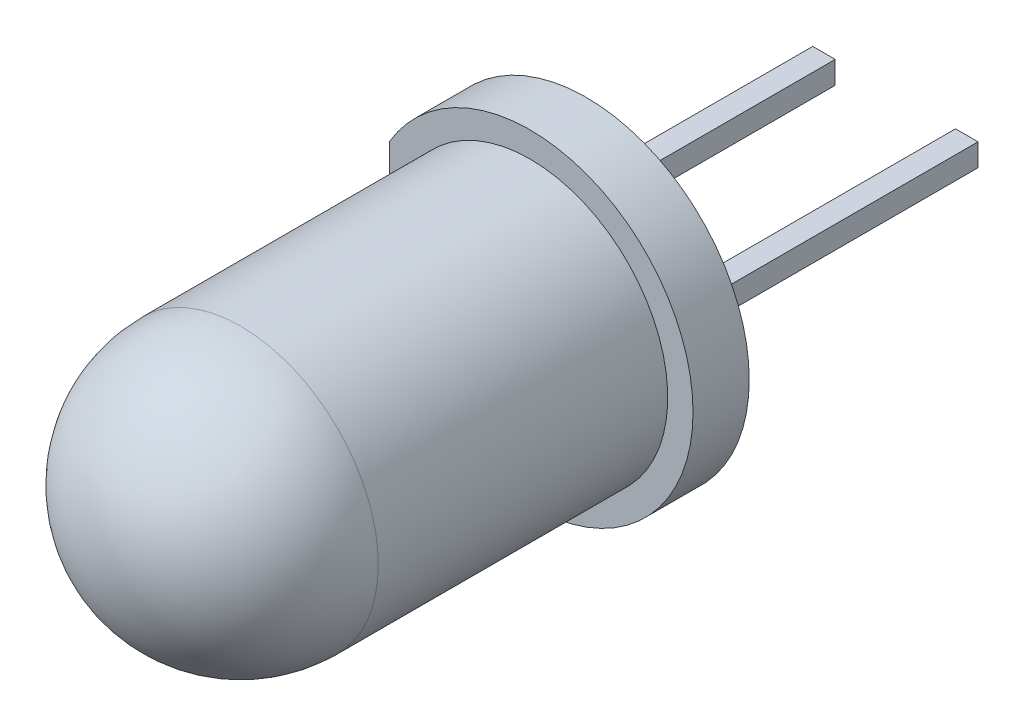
ISO-10303-21;
HEADER;
FILE_DESCRIPTION(('STEP AP214'),'2;1');
FILE_NAME('part.step','',(''),(''),'','','');
FILE_SCHEMA(('AUTOMOTIVE_DESIGN { 1 0 10303 214 1 1 1 1 }'));
ENDSEC;
DATA;
#1=APPLICATION_CONTEXT('core data for automotive mechanical design processes');
#2=APPLICATION_PROTOCOL_DEFINITION('international standard','automotive_design',2000,#1);
#3=PRODUCT_CONTEXT('',#1,'mechanical');
#4=PRODUCT('Part','Part','',(#3));
#5=PRODUCT_RELATED_PRODUCT_CATEGORY('part','',(#4));
#6=PRODUCT_DEFINITION_FORMATION('','',#4);
#7=PRODUCT_DEFINITION_CONTEXT('part definition',#1,'design');
#8=PRODUCT_DEFINITION('design','',#6,#7);
#9=PRODUCT_DEFINITION_SHAPE('','',#8);
#10=(LENGTH_UNIT() NAMED_UNIT(*) SI_UNIT(.MILLI.,.METRE.));
#11=(NAMED_UNIT(*) PLANE_ANGLE_UNIT() SI_UNIT($,.RADIAN.));
#12=(NAMED_UNIT(*) SI_UNIT($,.STERADIAN.) SOLID_ANGLE_UNIT());
#13=UNCERTAINTY_MEASURE_WITH_UNIT(LENGTH_MEASURE(1.E-05),#10,'distance_accuracy_value','');
#14=(GEOMETRIC_REPRESENTATION_CONTEXT(3) GLOBAL_UNCERTAINTY_ASSIGNED_CONTEXT((#13)) GLOBAL_UNIT_ASSIGNED_CONTEXT((#10,
#11,#12)) REPRESENTATION_CONTEXT('',''));
#15=CARTESIAN_POINT('',(0.,0.,0.));
#16=DIRECTION('',(0.,0.,1.));
#17=DIRECTION('',(1.,0.,0.));
#18=AXIS2_PLACEMENT_3D('',#15,#16,#17);
#19=CARTESIAN_POINT('',(0.2,0.2,3.5));
#20=DIRECTION('',(-1.,0.,0.));
#21=DIRECTION('',(0.,0.,1.));
#22=AXIS2_PLACEMENT_3D('',#19,#20,#21);
#23=PLANE('',#22);
#24=DIRECTION('',(0.,1.,0.));
#25=VECTOR('',#24,1.);
#26=CARTESIAN_POINT('',(0.2,0.2,-2.5));
#27=LINE('',#26,#25);
#28=CARTESIAN_POINT('',(0.2,-0.2,-2.5));
#29=VERTEX_POINT('',#28);
#30=CARTESIAN_POINT('',(0.2,0.2,-2.5));
#31=VERTEX_POINT('',#30);
#32=EDGE_CURVE('E127',#29,#31,#27,.T.);
#33=ORIENTED_EDGE('',*,*,#32,.T.);
#34=DIRECTION('',(0.,0.,-1.));
#35=VECTOR('',#34,1.);
#36=CARTESIAN_POINT('',(0.2,0.2,3.5));
#37=LINE('',#36,#35);
#38=CARTESIAN_POINT('',(0.2,0.2,3.));
#39=VERTEX_POINT('',#38);
#40=EDGE_CURVE('E119',#31,#39,#37,.F.);
#41=ORIENTED_EDGE('',*,*,#40,.T.);
#42=DIRECTION('',(0.,1.,0.));
#43=VECTOR('',#42,1.);
#44=CARTESIAN_POINT('',(0.2,0.2,3.));
#45=LINE('',#44,#43);
#46=CARTESIAN_POINT('',(0.2,-0.2,3.));
#47=VERTEX_POINT('',#46);
#48=EDGE_CURVE('E110',#47,#39,#45,.T.);
#49=ORIENTED_EDGE('',*,*,#48,.F.);
#50=DIRECTION('',(0.,0.,1.));
#51=VECTOR('',#50,1.);
#52=CARTESIAN_POINT('',(0.2,-0.2,3.5));
#53=LINE('',#52,#51);
#54=EDGE_CURVE('E103',#47,#29,#53,.F.);
#55=ORIENTED_EDGE('',*,*,#54,.T.);
#56=EDGE_LOOP('',(#33,#41,#49,#55));
#57=FACE_BOUND('',#56,.T.);
#58=ADVANCED_FACE('F17',(#57),#23,.F.);
#59=CARTESIAN_POINT('',(2.74,-0.2,3.5));
#60=DIRECTION('',(0.,1.,0.));
#61=DIRECTION('',(0.,0.,1.));
#62=AXIS2_PLACEMENT_3D('',#59,#60,#61);
#63=PLANE('',#62);
#64=DIRECTION('',(1.,0.,0.));
#65=VECTOR('',#64,1.);
#66=CARTESIAN_POINT('',(2.34,-0.2,-2.5));
#67=LINE('',#66,#65);
#68=CARTESIAN_POINT('',(2.34,-0.2,-2.5));
#69=VERTEX_POINT('',#68);
#70=CARTESIAN_POINT('',(2.74,-0.2,-2.5));
#71=VERTEX_POINT('',#70);
#72=EDGE_CURVE('E171',#69,#71,#67,.T.);
#73=ORIENTED_EDGE('',*,*,#72,.T.);
#74=DIRECTION('',(0.,0.,1.));
#75=VECTOR('',#74,1.);
#76=CARTESIAN_POINT('',(2.74,-0.2,3.5));
#77=LINE('',#76,#75);
#78=CARTESIAN_POINT('',(2.74,-0.2,3.));
#79=VERTEX_POINT('',#78);
#80=EDGE_CURVE('E164',#71,#79,#77,.T.);
#81=ORIENTED_EDGE('',*,*,#80,.T.);
#82=DIRECTION('',(1.,0.,0.));
#83=VECTOR('',#82,1.);
#84=CARTESIAN_POINT('',(2.74,-0.2,3.));
#85=LINE('',#84,#83);
#86=CARTESIAN_POINT('',(2.34,-0.2,3.));
#87=VERTEX_POINT('',#86);
#88=EDGE_CURVE('E116',#87,#79,#85,.T.);
#89=ORIENTED_EDGE('',*,*,#88,.F.);
#90=DIRECTION('',(0.,0.,-1.));
#91=VECTOR('',#90,1.);
#92=CARTESIAN_POINT('',(2.34,-0.2,3.5));
#93=LINE('',#92,#91);
#94=EDGE_CURVE('E176',#87,#69,#93,.T.);
#95=ORIENTED_EDGE('',*,*,#94,.T.);
#96=EDGE_LOOP('',(#73,#81,#89,#95));
#97=FACE_BOUND('',#96,.T.);
#98=ADVANCED_FACE('F238',(#97),#63,.F.);
#99=CARTESIAN_POINT('',(0.2,-0.2,3.5));
#100=DIRECTION('',(0.,1.,0.));
#101=DIRECTION('',(0.,0.,1.));
#102=AXIS2_PLACEMENT_3D('',#99,#100,#101);
#103=PLANE('',#102);
#104=DIRECTION('',(1.,0.,0.));
#105=VECTOR('',#104,1.);
#106=CARTESIAN_POINT('',(-0.2,-0.2,-2.5));
#107=LINE('',#106,#105);
#108=CARTESIAN_POINT('',(-0.2,-0.2,-2.5));
#109=VERTEX_POINT('',#108);
#110=EDGE_CURVE('E124',#109,#29,#107,.T.);
#111=ORIENTED_EDGE('',*,*,#110,.T.);
#112=ORIENTED_EDGE('',*,*,#54,.F.);
#113=DIRECTION('',(1.,0.,0.));
#114=VECTOR('',#113,1.);
#115=CARTESIAN_POINT('',(0.2,-0.2,3.));
#116=LINE('',#115,#114);
#117=CARTESIAN_POINT('',(-0.2,-0.2,3.));
#118=VERTEX_POINT('',#117);
#119=EDGE_CURVE('E108',#118,#47,#116,.T.);
#120=ORIENTED_EDGE('',*,*,#119,.F.);
#121=DIRECTION('',(0.,0.,-1.));
#122=VECTOR('',#121,1.);
#123=CARTESIAN_POINT('',(-0.2,-0.2,3.5));
#124=LINE('',#123,#122);
#125=EDGE_CURVE('E162',#118,#109,#124,.T.);
#126=ORIENTED_EDGE('',*,*,#125,.T.);
#127=EDGE_LOOP('',(#111,#112,#120,#126));
#128=FACE_BOUND('',#127,.T.);
#129=ADVANCED_FACE('F122',(#128),#103,.F.);
#130=CARTESIAN_POINT('',(-0.2,0.2,-2.5));
#131=DIRECTION('',(0.,0.,1.));
#132=DIRECTION('',(1.,0.,0.));
#133=AXIS2_PLACEMENT_3D('',#130,#131,#132);
#134=PLANE('',#133);
#135=ORIENTED_EDGE('',*,*,#32,.F.);
#136=ORIENTED_EDGE('',*,*,#110,.F.);
#137=DIRECTION('',(0.,1.,0.));
#138=VECTOR('',#137,1.);
#139=CARTESIAN_POINT('',(-0.2,-0.2,-2.5));
#140=LINE('',#139,#138);
#141=CARTESIAN_POINT('',(-0.2,0.2,-2.5));
#142=VERTEX_POINT('',#141);
#143=EDGE_CURVE('E160',#109,#142,#140,.T.);
#144=ORIENTED_EDGE('',*,*,#143,.T.);
#145=DIRECTION('',(1.,0.,0.));
#146=VECTOR('',#145,1.);
#147=CARTESIAN_POINT('',(-0.2,0.2,-2.5));
#148=LINE('',#147,#146);
#149=EDGE_CURVE('E181',#142,#31,#148,.T.);
#150=ORIENTED_EDGE('',*,*,#149,.T.);
#151=EDGE_LOOP('',(#135,#136,#144,#150));
#152=FACE_BOUND('',#151,.T.);
#153=ADVANCED_FACE('F187',(#152),#134,.F.);
#154=CARTESIAN_POINT('',(-0.2,0.2,3.5));
#155=DIRECTION('',(0.,-1.,0.));
#156=DIRECTION('',(0.,0.,-1.));
#157=AXIS2_PLACEMENT_3D('',#154,#155,#156);
#158=PLANE('',#157);
#159=ORIENTED_EDGE('',*,*,#149,.F.);
#160=DIRECTION('',(0.,0.,-1.));
#161=VECTOR('',#160,1.);
#162=CARTESIAN_POINT('',(-0.2,0.2,3.5));
#163=LINE('',#162,#161);
#164=CARTESIAN_POINT('',(-0.2,0.2,3.));
#165=VERTEX_POINT('',#164);
#166=EDGE_CURVE('E157',#142,#165,#163,.F.);
#167=ORIENTED_EDGE('',*,*,#166,.T.);
#168=DIRECTION('',(1.,0.,0.));
#169=VECTOR('',#168,1.);
#170=CARTESIAN_POINT('',(-0.2,0.2,3.));
#171=LINE('',#170,#169);
#172=EDGE_CURVE('E184',#39,#165,#171,.F.);
#173=ORIENTED_EDGE('',*,*,#172,.F.);
#174=ORIENTED_EDGE('',*,*,#40,.F.);
#175=EDGE_LOOP('',(#159,#167,#173,#174));
#176=FACE_BOUND('',#175,.T.);
#177=ADVANCED_FACE('F191',(#176),#158,.F.);
#178=CARTESIAN_POINT('',(2.34,-0.2,3.5));
#179=DIRECTION('',(1.,0.,0.));
#180=DIRECTION('',(0.,0.,-1.));
#181=AXIS2_PLACEMENT_3D('',#178,#179,#180);
#182=PLANE('',#181);
#183=DIRECTION('',(0.,1.,0.));
#184=VECTOR('',#183,1.);
#185=CARTESIAN_POINT('',(2.34,0.2,-2.5));
#186=LINE('',#185,#184);
#187=CARTESIAN_POINT('',(2.34,0.2,-2.5));
#188=VERTEX_POINT('',#187);
#189=EDGE_CURVE('E173',#188,#69,#186,.F.);
#190=ORIENTED_EDGE('',*,*,#189,.T.);
#191=ORIENTED_EDGE('',*,*,#94,.F.);
#192=DIRECTION('',(0.,1.,0.));
#193=VECTOR('',#192,1.);
#194=CARTESIAN_POINT('',(2.34,-0.2,3.));
#195=LINE('',#194,#193);
#196=CARTESIAN_POINT('',(2.34,0.2,3.));
#197=VERTEX_POINT('',#196);
#198=EDGE_CURVE('E178',#197,#87,#195,.F.);
#199=ORIENTED_EDGE('',*,*,#198,.F.);
#200=DIRECTION('',(0.,0.,-1.));
#201=VECTOR('',#200,1.);
#202=CARTESIAN_POINT('',(2.34,0.2,3.5));
#203=LINE('',#202,#201);
#204=EDGE_CURVE('E155',#197,#188,#203,.T.);
#205=ORIENTED_EDGE('',*,*,#204,.T.);
#206=EDGE_LOOP('',(#190,#191,#199,#205));
#207=FACE_BOUND('',#206,.T.);
#208=ADVANCED_FACE('F228',(#207),#182,.F.);
#209=CARTESIAN_POINT('',(2.34,0.2,-2.5));
#210=DIRECTION('',(0.,0.,1.));
#211=DIRECTION('',(1.,0.,0.));
#212=AXIS2_PLACEMENT_3D('',#209,#210,#211);
#213=PLANE('',#212);
#214=DIRECTION('',(0.,1.,0.));
#215=VECTOR('',#214,1.);
#216=CARTESIAN_POINT('',(2.74,0.2,-2.5));
#217=LINE('',#216,#215);
#218=CARTESIAN_POINT('',(2.74,0.2,-2.5));
#219=VERTEX_POINT('',#218);
#220=EDGE_CURVE('E167',#219,#71,#217,.F.);
#221=ORIENTED_EDGE('',*,*,#220,.T.);
#222=ORIENTED_EDGE('',*,*,#72,.F.);
#223=ORIENTED_EDGE('',*,*,#189,.F.);
#224=DIRECTION('',(1.,0.,0.));
#225=VECTOR('',#224,1.);
#226=CARTESIAN_POINT('',(2.34,0.2,-2.5));
#227=LINE('',#226,#225);
#228=EDGE_CURVE('E153',#188,#219,#227,.T.);
#229=ORIENTED_EDGE('',*,*,#228,.T.);
#230=EDGE_LOOP('',(#221,#222,#223,#229));
#231=FACE_BOUND('',#230,.T.);
#232=ADVANCED_FACE('F224',(#231),#213,.F.);
#233=CARTESIAN_POINT('',(2.74,0.2,3.5));
#234=DIRECTION('',(-1.,0.,0.));
#235=DIRECTION('',(0.,0.,1.));
#236=AXIS2_PLACEMENT_3D('',#233,#234,#235);
#237=PLANE('',#236);
#238=ORIENTED_EDGE('',*,*,#220,.F.);
#239=DIRECTION('',(0.,0.,-1.));
#240=VECTOR('',#239,1.);
#241=CARTESIAN_POINT('',(2.74,0.2,3.5));
#242=LINE('',#241,#240);
#243=CARTESIAN_POINT('',(2.74,0.2,3.));
#244=VERTEX_POINT('',#243);
#245=EDGE_CURVE('E151',#219,#244,#242,.F.);
#246=ORIENTED_EDGE('',*,*,#245,.T.);
#247=DIRECTION('',(0.,1.,0.));
#248=VECTOR('',#247,1.);
#249=CARTESIAN_POINT('',(2.74,0.2,3.));
#250=LINE('',#249,#248);
#251=EDGE_CURVE('E59',#79,#244,#250,.T.);
#252=ORIENTED_EDGE('',*,*,#251,.F.);
#253=ORIENTED_EDGE('',*,*,#80,.F.);
#254=EDGE_LOOP('',(#238,#246,#252,#253));
#255=FACE_BOUND('',#254,.T.);
#256=ADVANCED_FACE('F221',(#255),#237,.F.);
#257=CARTESIAN_POINT('',(-0.2,-0.2,3.5));
#258=DIRECTION('',(1.,0.,0.));
#259=DIRECTION('',(0.,0.,-1.));
#260=AXIS2_PLACEMENT_3D('',#257,#258,#259);
#261=PLANE('',#260);
#262=ORIENTED_EDGE('',*,*,#143,.F.);
#263=ORIENTED_EDGE('',*,*,#125,.F.);
#264=DIRECTION('',(0.,1.,0.));
#265=VECTOR('',#264,1.);
#266=CARTESIAN_POINT('',(-0.2,-1.469693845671,3.));
#267=LINE('',#266,#265);
#268=EDGE_CURVE('E113',#165,#118,#267,.F.);
#269=ORIENTED_EDGE('',*,*,#268,.F.);
#270=ORIENTED_EDGE('',*,*,#166,.F.);
#271=EDGE_LOOP('',(#262,#263,#269,#270));
#272=FACE_BOUND('',#271,.T.);
#273=ADVANCED_FACE('F193',(#272),#261,.F.);
#274=CARTESIAN_POINT('',(2.34,0.2,3.5));
#275=DIRECTION('',(0.,-1.,0.));
#276=DIRECTION('',(0.,0.,-1.));
#277=AXIS2_PLACEMENT_3D('',#274,#275,#276);
#278=PLANE('',#277);
#279=ORIENTED_EDGE('',*,*,#228,.F.);
#280=ORIENTED_EDGE('',*,*,#204,.F.);
#281=DIRECTION('',(-1.,0.,0.));
#282=VECTOR('',#281,1.);
#283=CARTESIAN_POINT('',(-1.229999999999,0.2,3.));
#284=LINE('',#283,#282);
#285=EDGE_CURVE('E194',#244,#197,#284,.T.);
#286=ORIENTED_EDGE('',*,*,#285,.F.);
#287=ORIENTED_EDGE('',*,*,#245,.F.);
#288=EDGE_LOOP('',(#279,#280,#286,#287));
#289=FACE_BOUND('',#288,.T.);
#290=ADVANCED_FACE('F215',(#289),#278,.F.);
#291=CARTESIAN_POINT('',(-1.229999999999,-1.469693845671,3.));
#292=DIRECTION('',(0.,0.,-1.));
#293=DIRECTION('',(-1.,0.,0.));
#294=AXIS2_PLACEMENT_3D('',#291,#292,#293);
#295=PLANE('',#294);
#296=ORIENTED_EDGE('',*,*,#251,.T.);
#297=ORIENTED_EDGE('',*,*,#285,.T.);
#298=ORIENTED_EDGE('',*,*,#198,.T.);
#299=ORIENTED_EDGE('',*,*,#88,.T.);
#300=EDGE_LOOP('',(#296,#297,#298,#299));
#301=FACE_BOUND('',#300,.T.);
#302=ORIENTED_EDGE('',*,*,#172,.T.);
#303=ORIENTED_EDGE('',*,*,#268,.T.);
#304=ORIENTED_EDGE('',*,*,#119,.T.);
#305=ORIENTED_EDGE('',*,*,#48,.T.);
#306=EDGE_LOOP('',(#302,#303,#304,#305));
#307=FACE_BOUND('',#306,.T.);
#308=CARTESIAN_POINT('',(1.27,0.,3.));
#309=DIRECTION('',(0.,0.,-1.));
#310=DIRECTION('',(-1.,0.,0.));
#311=AXIS2_PLACEMENT_3D('',#308,#309,#310);
#312=CIRCLE('',#311,2.9);
#313=CARTESIAN_POINT('',(-1.229999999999,-1.4696938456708,3.));
#314=VERTEX_POINT('',#313);
#315=CARTESIAN_POINT('',(-1.229999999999,1.4696938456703,3.));
#316=VERTEX_POINT('',#315);
#317=EDGE_CURVE('E20',#314,#316,#312,.F.);
#318=ORIENTED_EDGE('',*,*,#317,.F.);
#319=DIRECTION('',(0.,1.,0.));
#320=VECTOR('',#319,1.);
#321=CARTESIAN_POINT('',(-1.229999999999,-1.46969384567,3.));
#322=LINE('',#321,#320);
#323=EDGE_CURVE('E135',#316,#314,#322,.F.);
#324=ORIENTED_EDGE('',*,*,#323,.F.);
#325=EDGE_LOOP('',(#318,#324));
#326=FACE_BOUND('',#325,.T.);
#327=ADVANCED_FACE('F109',(#301,#307,#326),#295,.T.);
#328=CARTESIAN_POINT('',(1.27,0.,3.));
#329=DIRECTION('',(0.,0.,-1.));
#330=DIRECTION('',(-1.,0.,0.));
#331=AXIS2_PLACEMENT_3D('',#328,#329,#330);
#332=CYLINDRICAL_SURFACE('',#331,2.9);
#333=CARTESIAN_POINT('',(1.27,0.,4.));
#334=DIRECTION('',(0.,0.,-1.));
#335=DIRECTION('',(-1.,0.,0.));
#336=AXIS2_PLACEMENT_3D('',#333,#334,#335);
#337=CIRCLE('',#336,2.9);
#338=CARTESIAN_POINT('',(-1.229999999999,1.4696938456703,4.));
#339=VERTEX_POINT('',#338);
#340=CARTESIAN_POINT('',(-1.229999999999,-1.4696938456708,4.));
#341=VERTEX_POINT('',#340);
#342=EDGE_CURVE('E133',#339,#341,#337,.T.);
#343=ORIENTED_EDGE('',*,*,#342,.T.);
#344=DIRECTION('',(0.,0.,1.));
#345=VECTOR('',#344,1.);
#346=CARTESIAN_POINT('',(-1.229999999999,-1.46969384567,3.));
#347=LINE('',#346,#345);
#348=EDGE_CURVE('E146',#314,#341,#347,.T.);
#349=ORIENTED_EDGE('',*,*,#348,.F.);
#350=ORIENTED_EDGE('',*,*,#317,.T.);
#351=DIRECTION('',(0.,0.,1.));
#352=VECTOR('',#351,1.);
#353=CARTESIAN_POINT('',(-1.229999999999,1.469693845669,3.));
#354=LINE('',#353,#352);
#355=EDGE_CURVE('E142',#339,#316,#354,.F.);
#356=ORIENTED_EDGE('',*,*,#355,.F.);
#357=EDGE_LOOP('',(#343,#349,#350,#356));
#358=FACE_BOUND('',#357,.T.);
#359=ADVANCED_FACE('F210',(#358),#332,.T.);
#360=CARTESIAN_POINT('',(-1.229999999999,-1.46969384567,3.));
#361=DIRECTION('',(-1.,0.,0.));
#362=DIRECTION('',(0.,0.,1.));
#363=AXIS2_PLACEMENT_3D('',#360,#361,#362);
#364=PLANE('',#363);
#365=ORIENTED_EDGE('',*,*,#355,.T.);
#366=ORIENTED_EDGE('',*,*,#323,.T.);
#367=ORIENTED_EDGE('',*,*,#348,.T.);
#368=DIRECTION('',(0.,1.,0.));
#369=VECTOR('',#368,1.);
#370=CARTESIAN_POINT('',(-1.229999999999,-1.469693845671,4.));
#371=LINE('',#370,#369);
#372=EDGE_CURVE('E134',#341,#339,#371,.T.);
#373=ORIENTED_EDGE('',*,*,#372,.T.);
#374=EDGE_LOOP('',(#365,#366,#367,#373));
#375=FACE_BOUND('',#374,.T.);
#376=ADVANCED_FACE('F206',(#375),#364,.T.);
#377=CARTESIAN_POINT('',(1.27,0.,9.15));
#378=DIRECTION('',(1.,0.,0.));
#379=DIRECTION('',(0.,1.,0.));
#380=AXIS2_PLACEMENT_3D('',#377,#378,#379);
#381=SPHERICAL_SURFACE('',#380,2.45);
#382=CARTESIAN_POINT('',(1.27,0.,9.15));
#383=DIRECTION('',(0.,0.,-1.));
#384=DIRECTION('',(0.,1.,0.));
#385=AXIS2_PLACEMENT_3D('',#382,#383,#384);
#386=CIRCLE('',#385,2.45);
#387=CARTESIAN_POINT('',(3.72,0.,9.15));
#388=VERTEX_POINT('',#387);
#389=CARTESIAN_POINT('',(-1.18,0.,9.15));
#390=VERTEX_POINT('',#389);
#391=EDGE_CURVE('E132',#388,#390,#386,.T.);
#392=ORIENTED_EDGE('',*,*,#391,.F.);
#393=CARTESIAN_POINT('',(1.27,0.,9.15));
#394=DIRECTION('',(0.,0.,-1.));
#395=DIRECTION('',(0.,1.,0.));
#396=AXIS2_PLACEMENT_3D('',#393,#394,#395);
#397=CIRCLE('',#396,2.45);
#398=EDGE_CURVE('E26',#390,#388,#397,.T.);
#399=ORIENTED_EDGE('',*,*,#398,.F.);
#400=EDGE_LOOP('',(#392,#399));
#401=FACE_BOUND('',#400,.T.);
#402=ADVANCED_FACE('F201',(#401),#381,.T.);
#403=CARTESIAN_POINT('',(-1.229999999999,-1.469693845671,4.));
#404=DIRECTION('',(0.,0.,-1.));
#405=DIRECTION('',(-1.,0.,0.));
#406=AXIS2_PLACEMENT_3D('',#403,#404,#405);
#407=PLANE('',#406);
#408=CARTESIAN_POINT('',(1.27,0.,4.));
#409=DIRECTION('',(0.,0.,-1.));
#410=DIRECTION('',(0.,1.,0.));
#411=AXIS2_PLACEMENT_3D('',#408,#409,#410);
#412=CIRCLE('',#411,2.45);
#413=CARTESIAN_POINT('',(1.27,2.45,4.));
#414=VERTEX_POINT('',#413);
#415=EDGE_CURVE('E11',#414,#414,#412,.F.);
#416=ORIENTED_EDGE('',*,*,#415,.F.);
#417=EDGE_LOOP('',(#416));
#418=FACE_BOUND('',#417,.T.);
#419=ORIENTED_EDGE('',*,*,#342,.F.);
#420=ORIENTED_EDGE('',*,*,#372,.F.);
#421=EDGE_LOOP('',(#419,#420));
#422=FACE_BOUND('',#421,.T.);
#423=ADVANCED_FACE('F205',(#418,#422),#407,.F.);
#424=CARTESIAN_POINT('',(1.27,0.,9.15));
#425=DIRECTION('',(0.,0.,-1.));
#426=DIRECTION('',(0.,1.,0.));
#427=AXIS2_PLACEMENT_3D('',#424,#425,#426);
#428=CYLINDRICAL_SURFACE('',#427,2.45);
#429=ORIENTED_EDGE('',*,*,#398,.T.);
#430=ORIENTED_EDGE('',*,*,#391,.T.);
#431=EDGE_LOOP('',(#429,#430));
#432=FACE_BOUND('',#431,.T.);
#433=ORIENTED_EDGE('',*,*,#415,.T.);
#434=EDGE_LOOP('',(#433));
#435=FACE_BOUND('',#434,.T.);
#436=ADVANCED_FACE('F245',(#432,#435),#428,.T.);
#437=CLOSED_SHELL('',(#58,#98,#129,#153,#177,#208,#232,#256,#273,#290,#327,#359,#376,#402,#423,#436));
#438=MANIFOLD_SOLID_BREP('B1',#437);
#439=ADVANCED_BREP_SHAPE_REPRESENTATION('',(#18,#438),#14);
#440=SHAPE_DEFINITION_REPRESENTATION(#9,#439);
ENDSEC;
END-ISO-10303-21;
